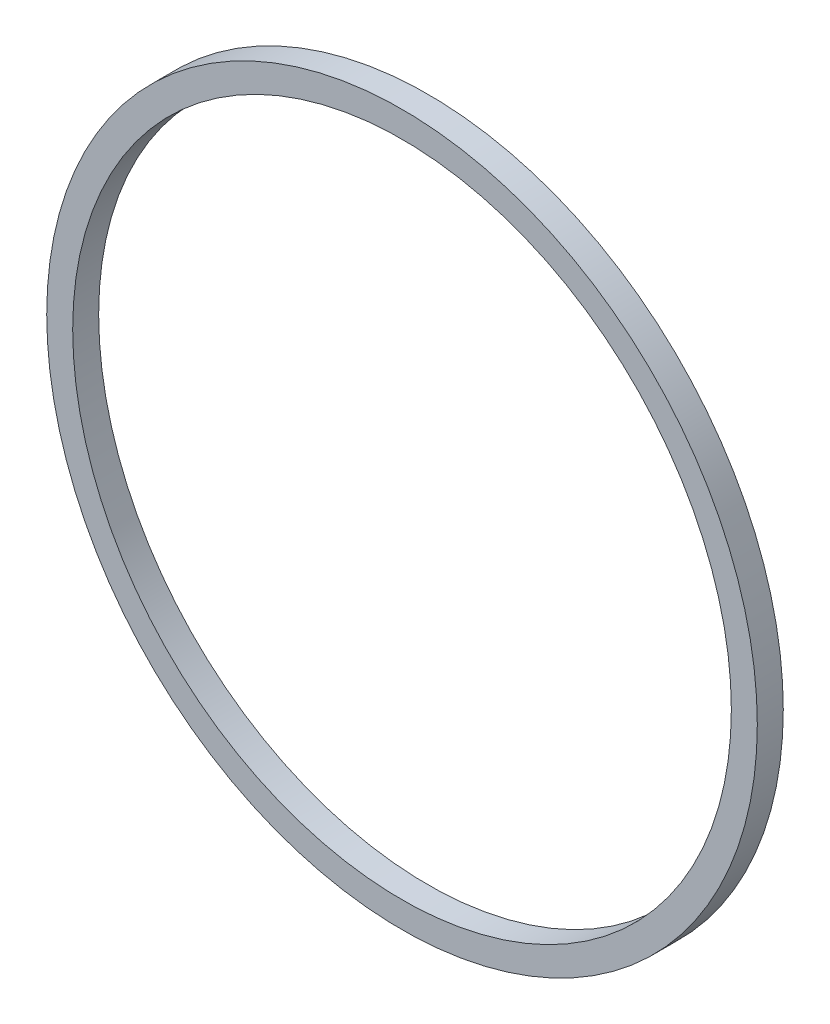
from build123d import *

# Parameters (mm, degrees)
SKETCH1_W = 6.985
SKETCH1_H = 6.985


with BuildPart() as part:
    # Sketch1 → Revolve1 (revolve)
    with BuildSketch(Plane(origin=(0, 0, 0), x_dir=(1, 0, 0), z_dir=(0, 1, 0))):
        with Locations((92.075, 0)):
            Rectangle(SKETCH1_W, SKETCH1_H)
    revolve(axis=Axis((0, 0, 3.4925), (0, 0, -1)))


solid = part.part
